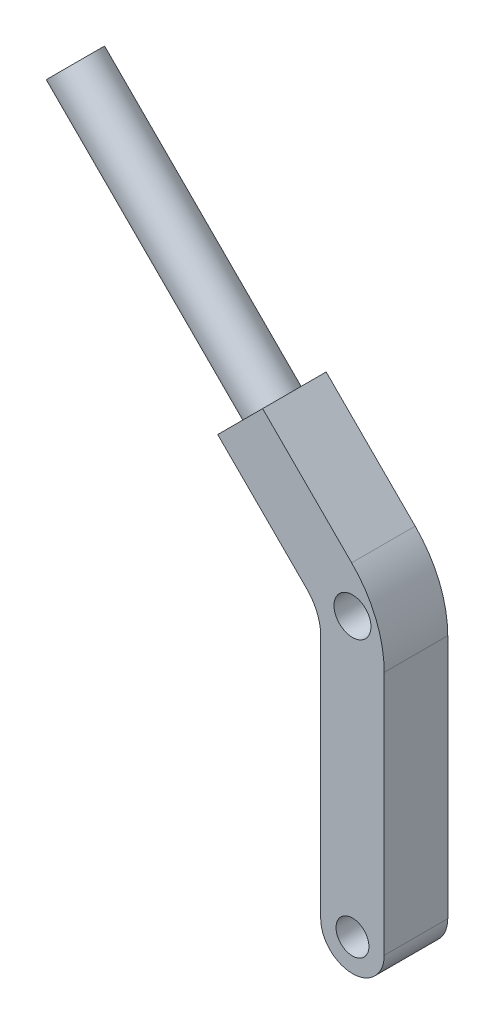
from build123d import *

# Parameters (mm, degrees)
SKETCH1_R           = 4.136825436
SKETCH1_R_2         = 4.652653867
BOSS_EXTRUDE1_DEPTH = 8
SKETCH2_R           = 6
BOSS_EXTRUDE2_DEPTH = 70


with BuildPart() as part:
    # Sketch1 → Boss-Extrude1 (new, symmetric)
    with BuildSketch(Plane.XY):
        with BuildLine():
            Line((8, -8.284271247), (8, -70))
            ThreePointArc((8, -70), (0, -78), (-8, -70))
            Line((-8, -70), (-8, -8.284271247))
            ThreePointArc((-8, -8.284271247), (-8.91344561, -3.692070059), (-11.514718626, 0.201010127))
            Line((-11.514718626, 0.201010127), (-33.941125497, 22.627416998))
            Line((-33.941125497, 22.627416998), (-22.627416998, 33.941125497))
            Line((-22.627416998, 33.941125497), (-0.201010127, 11.514718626))
            ThreePointArc((-0.201010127, 11.514718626), (5.86862691, 2.430864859), (8, -8.284271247))
        make_face()
        with Locations((0, -70)):
            Circle(SKETCH1_R, mode=Mode.SUBTRACT)
        Circle(SKETCH1_R_2, mode=Mode.SUBTRACT)
    extrude(amount=BOSS_EXTRUDE1_DEPTH, both=True)

    # Sketch2 → Boss-Extrude2 (add)
    with BuildSketch(Plane(origin=(-28.284271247, 28.284271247, 0), x_dir=(0, 0, 1), z_dir=(-0.7071067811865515, 0.7071067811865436, 0))):
        with Locations(Location((0, 0, 0), (0, 0, 270))):
            Circle(SKETCH2_R)
    extrude(amount=BOSS_EXTRUDE2_DEPTH)


solid = part.part
